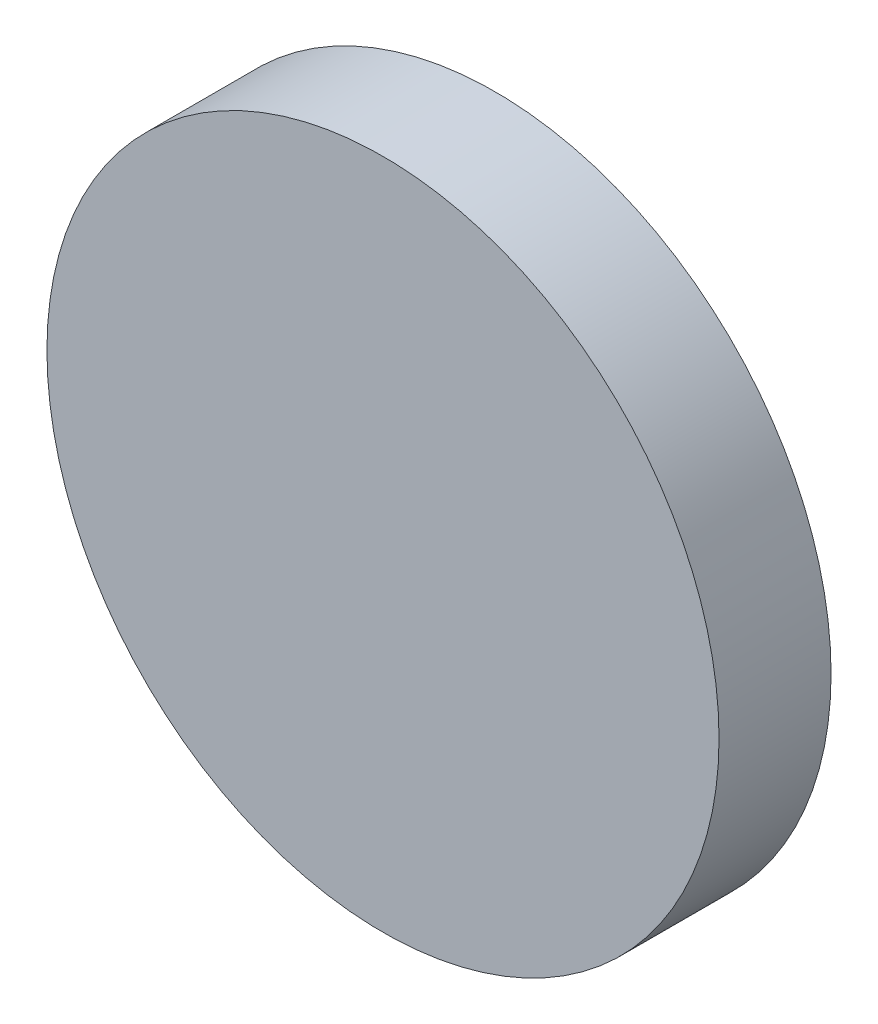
ISO-10303-21;
HEADER;
FILE_DESCRIPTION(('STEP AP214'),'2;1');
FILE_NAME('part.step','',(''),(''),'','','');
FILE_SCHEMA(('AUTOMOTIVE_DESIGN { 1 0 10303 214 1 1 1 1 }'));
ENDSEC;
DATA;
#1=APPLICATION_CONTEXT('core data for automotive mechanical design processes');
#2=APPLICATION_PROTOCOL_DEFINITION('international standard','automotive_design',2000,#1);
#3=PRODUCT_CONTEXT('',#1,'mechanical');
#4=PRODUCT('Part','Part','',(#3));
#5=PRODUCT_RELATED_PRODUCT_CATEGORY('part','',(#4));
#6=PRODUCT_DEFINITION_FORMATION('','',#4);
#7=PRODUCT_DEFINITION_CONTEXT('part definition',#1,'design');
#8=PRODUCT_DEFINITION('design','',#6,#7);
#9=PRODUCT_DEFINITION_SHAPE('','',#8);
#10=(LENGTH_UNIT() NAMED_UNIT(*) SI_UNIT(.MILLI.,.METRE.));
#11=(NAMED_UNIT(*) PLANE_ANGLE_UNIT() SI_UNIT($,.RADIAN.));
#12=(NAMED_UNIT(*) SI_UNIT($,.STERADIAN.) SOLID_ANGLE_UNIT());
#13=UNCERTAINTY_MEASURE_WITH_UNIT(LENGTH_MEASURE(1.E-05),#10,'distance_accuracy_value','');
#14=(GEOMETRIC_REPRESENTATION_CONTEXT(3) GLOBAL_UNCERTAINTY_ASSIGNED_CONTEXT((#13)) GLOBAL_UNIT_ASSIGNED_CONTEXT((#10,
#11,#12)) REPRESENTATION_CONTEXT('',''));
#15=CARTESIAN_POINT('',(0.,0.,0.));
#16=DIRECTION('',(0.,0.,1.));
#17=DIRECTION('',(1.,0.,0.));
#18=AXIS2_PLACEMENT_3D('',#15,#16,#17);
#19=CARTESIAN_POINT('',(0.,0.,3.));
#20=DIRECTION('',(0.,0.,-1.));
#21=DIRECTION('',(-1.,0.,0.));
#22=AXIS2_PLACEMENT_3D('',#19,#20,#21);
#23=CYLINDRICAL_SURFACE('',#22,9.);
#24=CARTESIAN_POINT('',(0.,0.,3.));
#25=DIRECTION('',(0.,0.,1.));
#26=DIRECTION('',(1.,0.,0.));
#27=AXIS2_PLACEMENT_3D('',#24,#25,#26);
#28=CIRCLE('',#27,9.);
#29=CARTESIAN_POINT('',(9.,0.,3.));
#30=VERTEX_POINT('',#29);
#31=EDGE_CURVE('E10',#30,#30,#28,.T.);
#32=ORIENTED_EDGE('',*,*,#31,.F.);
#33=EDGE_LOOP('',(#32));
#34=FACE_BOUND('',#33,.T.);
#35=CARTESIAN_POINT('',(0.,0.,0.));
#36=DIRECTION('',(0.,0.,1.));
#37=DIRECTION('',(1.,0.,0.));
#38=AXIS2_PLACEMENT_3D('',#35,#36,#37);
#39=CIRCLE('',#38,9.);
#40=CARTESIAN_POINT('',(9.,0.,0.));
#41=VERTEX_POINT('',#40);
#42=EDGE_CURVE('E32',#41,#41,#39,.T.);
#43=ORIENTED_EDGE('',*,*,#42,.T.);
#44=EDGE_LOOP('',(#43));
#45=FACE_BOUND('',#44,.T.);
#46=ADVANCED_FACE('F26',(#34,#45),#23,.T.);
#47=CARTESIAN_POINT('',(0.,0.,3.));
#48=DIRECTION('',(0.,0.,1.));
#49=DIRECTION('',(1.,0.,0.));
#50=AXIS2_PLACEMENT_3D('',#47,#48,#49);
#51=PLANE('',#50);
#52=ORIENTED_EDGE('',*,*,#31,.T.);
#53=EDGE_LOOP('',(#52));
#54=FACE_BOUND('',#53,.T.);
#55=ADVANCED_FACE('F41',(#54),#51,.T.);
#56=CARTESIAN_POINT('',(0.,0.,0.));
#57=DIRECTION('',(0.,0.,1.));
#58=DIRECTION('',(1.,0.,0.));
#59=AXIS2_PLACEMENT_3D('',#56,#57,#58);
#60=PLANE('',#59);
#61=ORIENTED_EDGE('',*,*,#42,.F.);
#62=EDGE_LOOP('',(#61));
#63=FACE_BOUND('',#62,.T.);
#64=ADVANCED_FACE('F39',(#63),#60,.F.);
#65=CLOSED_SHELL('',(#46,#55,#64));
#66=MANIFOLD_SOLID_BREP('B2',#65);
#67=ADVANCED_BREP_SHAPE_REPRESENTATION('',(#18,#66),#14);
#68=SHAPE_DEFINITION_REPRESENTATION(#9,#67);
ENDSEC;
END-ISO-10303-21;
